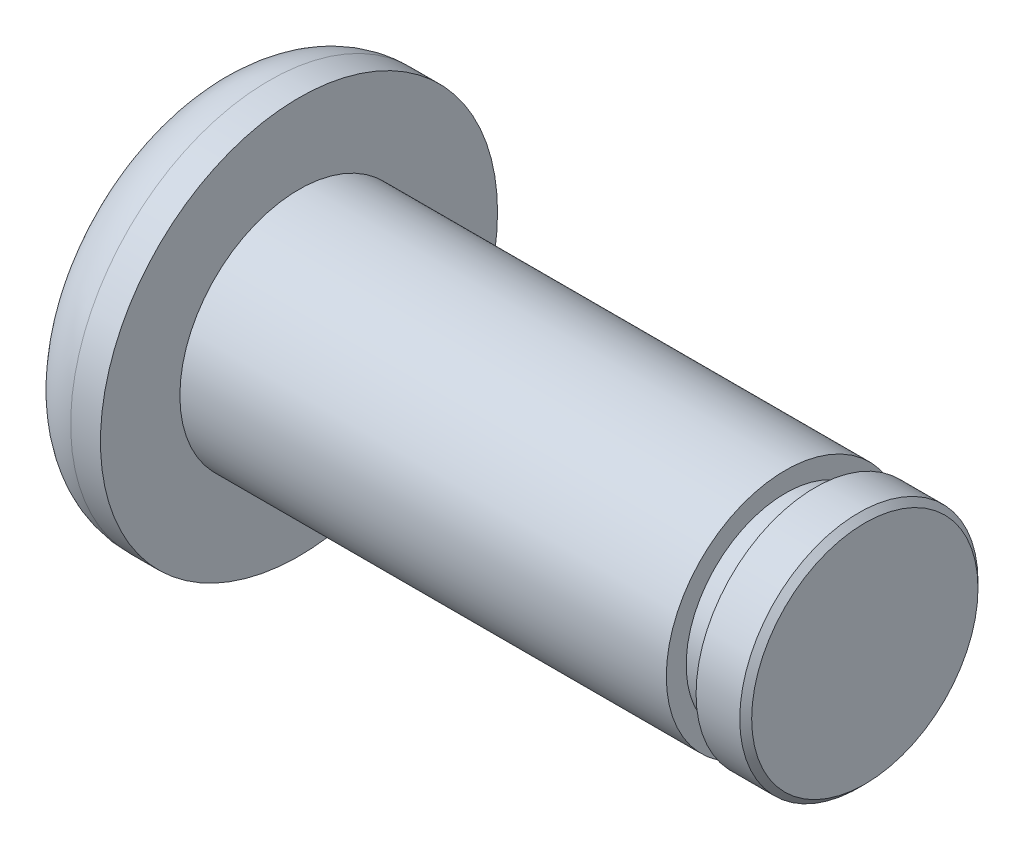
from build123d import *

# Parameters (mm, degrees)
CHANFREIN1_SIZE = 0.3


with BuildPart() as part:
    # Esquisse1 → R_volution1 (revolve)
    with BuildSketch(Plane.XY, mode=Mode.PRIVATE) as r_volution1_sk:
        with BuildLine():
            Line((28.5, 0), (28.5, 6))
            Line((28.5, 6), (26, 6))
            Line((26, 6), (26, 5))
            Line((26, 5), (24.5, 5))
            Line((24.5, 5), (24.5, 6))
            Line((24.5, 6), (0, 6))
            Line((0, 6), (0, 10))
            Line((0, 10), (-1.5, 10))
            ThreePointArc((-1.5, 10), (-3.621320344, 9.121320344), (-4.5, 7))
            Line((-4.5, 7), (-4.5, 0))
            Line((-4.5, 0), (28.5, 0))
        make_face()
    revolve(r_volution1_sk.sketch.rotate(Axis((0, 0, 0), (-1, 0, 0)), 90), axis=Axis((0, 0, 0), (-1, 0, 0)))

    # Chanfrein1
    chanfrein1_edges = [part.edges().sort_by_distance(p)[0] for p in [
        (28.5, 0, 6),
    ]]
    chamfer(chanfrein1_edges, length=CHANFREIN1_SIZE)


solid = part.part
